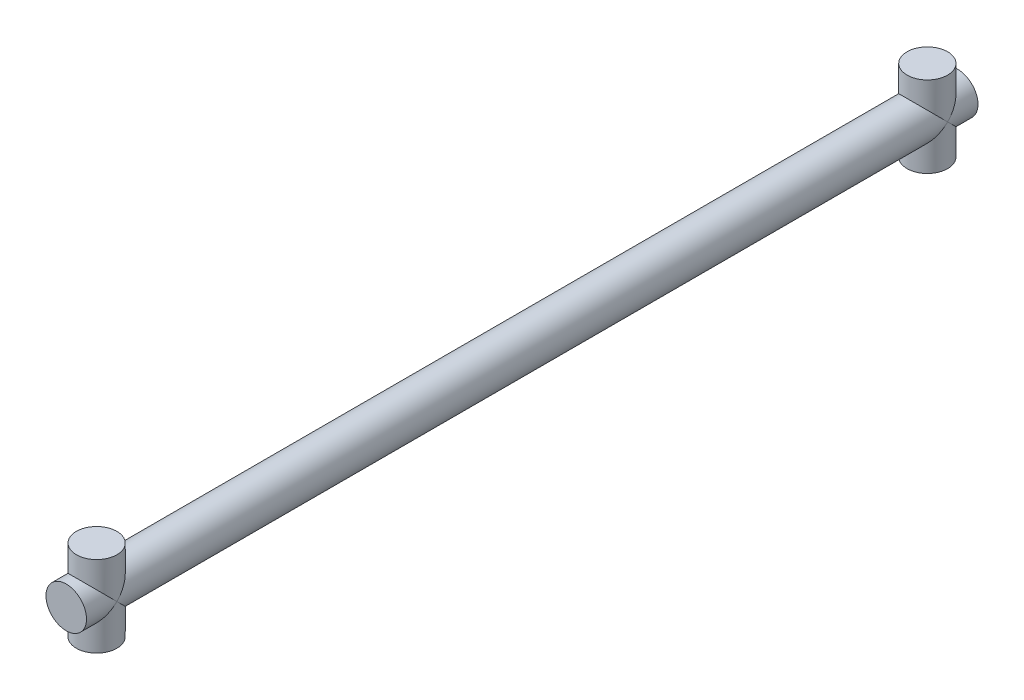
from build123d import *

# Parameters (mm, degrees)
ESQUISSE1_R        = 2.5
BOSS_EXTRU_1_DEPTH = 55
ESQUISSE2_R        = 2.5
BOSS_EXTRU_2_DEPTH = 5


with BuildPart() as part:
    # Esquisse1 → Boss.-Extru.1 (new, symmetric)
    with BuildSketch(Plane.XY):
        Circle(ESQUISSE1_R)
    extrude(amount=BOSS_EXTRU_1_DEPTH, both=True)

    # Esquisse2 → Boss.-Extru.2 (add, symmetric)
    with BuildSketch(Plane(origin=(0, 0, 0), x_dir=(1, 0, 0), z_dir=(0, 1, 0))):
        with Locations((0, 51.25)):
            Circle(ESQUISSE2_R)
        with Locations((0, -51.25)):
            Circle(ESQUISSE2_R)
    extrude(amount=BOSS_EXTRU_2_DEPTH, both=True)


solid = part.part
